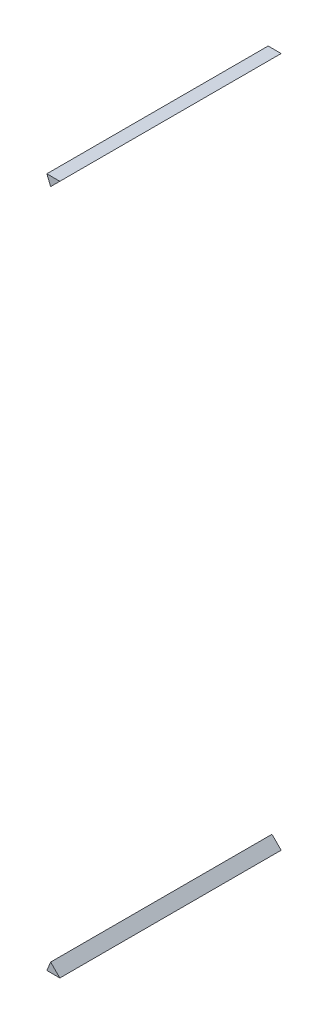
ISO-10303-21;
HEADER;
FILE_DESCRIPTION(('STEP AP214'),'2;1');
FILE_NAME('part.step','',(''),(''),'','','');
FILE_SCHEMA(('AUTOMOTIVE_DESIGN { 1 0 10303 214 1 1 1 1 }'));
ENDSEC;
DATA;
#1=APPLICATION_CONTEXT('core data for automotive mechanical design processes');
#2=APPLICATION_PROTOCOL_DEFINITION('international standard','automotive_design',2000,#1);
#3=PRODUCT_CONTEXT('',#1,'mechanical');
#4=PRODUCT('Part','Part','',(#3));
#5=PRODUCT_RELATED_PRODUCT_CATEGORY('part','',(#4));
#6=PRODUCT_DEFINITION_FORMATION('','',#4);
#7=PRODUCT_DEFINITION_CONTEXT('part definition',#1,'design');
#8=PRODUCT_DEFINITION('design','',#6,#7);
#9=PRODUCT_DEFINITION_SHAPE('','',#8);
#10=(LENGTH_UNIT() NAMED_UNIT(*) SI_UNIT(.MILLI.,.METRE.));
#11=(NAMED_UNIT(*) PLANE_ANGLE_UNIT() SI_UNIT($,.RADIAN.));
#12=(NAMED_UNIT(*) SI_UNIT($,.STERADIAN.) SOLID_ANGLE_UNIT());
#13=UNCERTAINTY_MEASURE_WITH_UNIT(LENGTH_MEASURE(1.E-05),#10,'distance_accuracy_value','');
#14=(GEOMETRIC_REPRESENTATION_CONTEXT(3) GLOBAL_UNCERTAINTY_ASSIGNED_CONTEXT((#13)) GLOBAL_UNIT_ASSIGNED_CONTEXT((#10,
#11,#12)) REPRESENTATION_CONTEXT('',''));
#15=CARTESIAN_POINT('',(0.,0.,0.));
#16=DIRECTION('',(0.,0.,1.));
#17=DIRECTION('',(1.,0.,0.));
#18=AXIS2_PLACEMENT_3D('',#15,#16,#17);
#19=CARTESIAN_POINT('',(512.126946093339,102.745484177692,19.9999999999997));
#20=DIRECTION('',(0.,0.,1.));
#21=DIRECTION('',(1.,0.,0.));
#22=AXIS2_PLACEMENT_3D('',#19,#20,#21);
#23=PLANE('',#22);
#24=DIRECTION('',(-0.382683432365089,-0.923879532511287,0.));
#25=VECTOR('',#24,1.);
#26=CARTESIAN_POINT('',(507.126946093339,102.745484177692,19.9999999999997));
#27=LINE('',#26,#25);
#28=CARTESIAN_POINT('',(508.591412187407,106.281018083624,19.9999999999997));
#29=VERTEX_POINT('',#28);
#30=CARTESIAN_POINT('',(507.126946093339,102.745484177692,19.9999999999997));
#31=VERTEX_POINT('',#30);
#32=EDGE_CURVE('P0_E50',#29,#31,#27,.T.);
#33=ORIENTED_EDGE('',*,*,#32,.F.);
#34=DIRECTION('',(0.707106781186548,-0.707106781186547,0.));
#35=VECTOR('',#34,1.);
#36=CARTESIAN_POINT('',(497.126946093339,117.745484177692,19.9999999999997));
#37=LINE('',#36,#35);
#38=CARTESIAN_POINT('',(512.126946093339,102.745484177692,19.9999999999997));
#39=VERTEX_POINT('',#38);
#40=EDGE_CURVE('P0_E20',#29,#39,#37,.T.);
#41=ORIENTED_EDGE('',*,*,#40,.T.);
#42=DIRECTION('',(1.,0.,0.));
#43=VECTOR('',#42,1.);
#44=CARTESIAN_POINT('',(422.12694609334,102.745484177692,19.9999999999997));
#45=LINE('',#44,#43);
#46=EDGE_CURVE('P0_E63',#39,#31,#45,.F.);
#47=ORIENTED_EDGE('',*,*,#46,.T.);
#48=EDGE_LOOP('',(#33,#41,#47));
#49=FACE_BOUND('',#48,.T.);
#50=ADVANCED_FACE('P0_F16',(#49),#23,.F.);
#51=CARTESIAN_POINT('',(422.12694609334,102.745484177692,0.));
#52=DIRECTION('',(0.,1.,0.));
#53=DIRECTION('',(0.,0.,1.));
#54=AXIS2_PLACEMENT_3D('',#51,#52,#53);
#55=PLANE('',#54);
#56=DIRECTION('',(0.,0.,1.));
#57=VECTOR('',#56,1.);
#58=CARTESIAN_POINT('',(507.126946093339,102.745484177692,19.9999999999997));
#59=LINE('',#58,#57);
#60=CARTESIAN_POINT('',(507.126946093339,102.745484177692,105.));
#61=VERTEX_POINT('',#60);
#62=EDGE_CURVE('P0_E58',#31,#61,#59,.T.);
#63=ORIENTED_EDGE('',*,*,#62,.F.);
#64=ORIENTED_EDGE('',*,*,#46,.F.);
#65=DIRECTION('',(0.,0.,1.));
#66=VECTOR('',#65,1.);
#67=CARTESIAN_POINT('',(512.126946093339,102.745484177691,19.9999999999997));
#68=LINE('',#67,#66);
#69=CARTESIAN_POINT('',(512.126946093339,102.745484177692,105.));
#70=VERTEX_POINT('',#69);
#71=EDGE_CURVE('P0_E59',#39,#70,#68,.T.);
#72=ORIENTED_EDGE('',*,*,#71,.T.);
#73=DIRECTION('',(1.,0.,0.));
#74=VECTOR('',#73,1.);
#75=CARTESIAN_POINT('',(512.126946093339,102.745484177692,105.));
#76=LINE('',#75,#74);
#77=EDGE_CURVE('P0_E56',#61,#70,#76,.T.);
#78=ORIENTED_EDGE('',*,*,#77,.F.);
#79=EDGE_LOOP('',(#63,#64,#72,#78));
#80=FACE_BOUND('',#79,.T.);
#81=ADVANCED_FACE('P0_F57',(#80),#55,.F.);
#82=CARTESIAN_POINT('',(512.126946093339,102.745484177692,105.));
#83=DIRECTION('',(0.,0.,1.));
#84=DIRECTION('',(1.,0.,0.));
#85=AXIS2_PLACEMENT_3D('',#82,#83,#84);
#86=PLANE('',#85);
#87=DIRECTION('',(0.707106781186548,-0.707106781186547,0.));
#88=VECTOR('',#87,1.);
#89=CARTESIAN_POINT('',(497.12694609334,117.745484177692,105.));
#90=LINE('',#89,#88);
#91=CARTESIAN_POINT('',(508.591412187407,106.281018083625,105.));
#92=VERTEX_POINT('',#91);
#93=EDGE_CURVE('P0_E26',#70,#92,#90,.F.);
#94=ORIENTED_EDGE('',*,*,#93,.T.);
#95=DIRECTION('',(-0.382683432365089,-0.923879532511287,0.));
#96=VECTOR('',#95,1.);
#97=CARTESIAN_POINT('',(507.126946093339,102.745484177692,105.));
#98=LINE('',#97,#96);
#99=EDGE_CURVE('P0_E34',#61,#92,#98,.F.);
#100=ORIENTED_EDGE('',*,*,#99,.F.);
#101=ORIENTED_EDGE('',*,*,#77,.T.);
#102=EDGE_LOOP('',(#94,#100,#101));
#103=FACE_BOUND('',#102,.T.);
#104=ADVANCED_FACE('P0_F67',(#103),#86,.T.);
#105=CARTESIAN_POINT('',(507.126946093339,102.745484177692,19.9999999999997));
#106=DIRECTION('',(-0.923879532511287,0.382683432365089,0.));
#107=DIRECTION('',(-0.382683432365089,-0.923879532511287,0.));
#108=AXIS2_PLACEMENT_3D('',#105,#106,#107);
#109=PLANE('',#108);
#110=ORIENTED_EDGE('',*,*,#32,.T.);
#111=ORIENTED_EDGE('',*,*,#62,.T.);
#112=ORIENTED_EDGE('',*,*,#99,.T.);
#113=DIRECTION('',(0.,0.,1.));
#114=VECTOR('',#113,1.);
#115=CARTESIAN_POINT('',(508.591412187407,106.281018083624,19.9999999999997));
#116=LINE('',#115,#114);
#117=EDGE_CURVE('P0_E10',#92,#29,#116,.F.);
#118=ORIENTED_EDGE('',*,*,#117,.T.);
#119=EDGE_LOOP('',(#110,#111,#112,#118));
#120=FACE_BOUND('',#119,.T.);
#121=ADVANCED_FACE('P0_F65',(#120),#109,.T.);
#122=CARTESIAN_POINT('',(497.126946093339,117.745484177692,19.9999999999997));
#123=DIRECTION('',(-0.707106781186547,-0.707106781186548,0.));
#124=DIRECTION('',(0.707106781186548,-0.707106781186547,0.));
#125=AXIS2_PLACEMENT_3D('',#122,#123,#124);
#126=PLANE('',#125);
#127=ORIENTED_EDGE('',*,*,#93,.F.);
#128=ORIENTED_EDGE('',*,*,#71,.F.);
#129=ORIENTED_EDGE('',*,*,#40,.F.);
#130=ORIENTED_EDGE('',*,*,#117,.F.);
#131=EDGE_LOOP('',(#127,#128,#129,#130));
#132=FACE_BOUND('',#131,.T.);
#133=ADVANCED_FACE('P0_F18',(#132),#126,.F.);
#134=CLOSED_SHELL('',(#50,#81,#104,#121,#133));
#135=MANIFOLD_SOLID_BREP('P0_B1',#134);
#136=CARTESIAN_POINT('',(508.591412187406,364.209950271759,19.9999999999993));
#137=DIRECTION('',(-0.923879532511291,-0.382683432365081,0.));
#138=DIRECTION('',(0.382683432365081,-0.923879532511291,0.));
#139=AXIS2_PLACEMENT_3D('',#136,#137,#138);
#140=PLANE('',#139);
#141=DIRECTION('',(0.382683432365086,-0.923879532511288,0.));
#142=VECTOR('',#141,1.);
#143=CARTESIAN_POINT('',(507.126946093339,367.745484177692,19.9999999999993));
#144=LINE('',#143,#142);
#145=CARTESIAN_POINT('',(507.126946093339,367.745484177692,19.9999999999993));
#146=VERTEX_POINT('',#145);
#147=CARTESIAN_POINT('',(508.591412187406,364.209950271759,19.9999999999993));
#148=VERTEX_POINT('',#147);
#149=EDGE_CURVE('P1_E54',#146,#148,#144,.T.);
#150=ORIENTED_EDGE('',*,*,#149,.T.);
#151=DIRECTION('',(0.,0.,1.));
#152=VECTOR('',#151,1.);
#153=CARTESIAN_POINT('',(508.591412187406,364.209950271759,19.9999999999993));
#154=LINE('',#153,#152);
#155=CARTESIAN_POINT('',(508.591412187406,364.209950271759,104.999999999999));
#156=VERTEX_POINT('',#155);
#157=EDGE_CURVE('P1_E53',#148,#156,#154,.T.);
#158=ORIENTED_EDGE('',*,*,#157,.T.);
#159=DIRECTION('',(0.382683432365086,-0.923879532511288,0.));
#160=VECTOR('',#159,1.);
#161=CARTESIAN_POINT('',(507.126946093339,367.745484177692,104.999999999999));
#162=LINE('',#161,#160);
#163=CARTESIAN_POINT('',(507.126946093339,367.745484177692,104.999999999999));
#164=VERTEX_POINT('',#163);
#165=EDGE_CURVE('P1_E69',#164,#156,#162,.T.);
#166=ORIENTED_EDGE('',*,*,#165,.F.);
#167=DIRECTION('',(0.,0.,-1.));
#168=VECTOR('',#167,1.);
#169=CARTESIAN_POINT('',(507.126946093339,367.745484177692,0.));
#170=LINE('',#169,#168);
#171=EDGE_CURVE('P1_E20',#164,#146,#170,.T.);
#172=ORIENTED_EDGE('',*,*,#171,.T.);
#173=EDGE_LOOP('',(#150,#158,#166,#172));
#174=FACE_BOUND('',#173,.T.);
#175=ADVANCED_FACE('P1_F16',(#174),#140,.T.);
#176=CARTESIAN_POINT('',(512.126946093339,367.745484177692,19.9999999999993));
#177=DIRECTION('',(0.,0.,1.));
#178=DIRECTION('',(1.,0.,0.));
#179=AXIS2_PLACEMENT_3D('',#176,#177,#178);
#180=PLANE('',#179);
#181=ORIENTED_EDGE('',*,*,#149,.F.);
#182=DIRECTION('',(1.,0.,0.));
#183=VECTOR('',#182,1.);
#184=CARTESIAN_POINT('',(817.156383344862,367.745484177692,19.9999999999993));
#185=LINE('',#184,#183);
#186=CARTESIAN_POINT('',(512.126946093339,367.745484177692,19.9999999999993));
#187=VERTEX_POINT('',#186);
#188=EDGE_CURVE('P1_E66',#146,#187,#185,.T.);
#189=ORIENTED_EDGE('',*,*,#188,.T.);
#190=DIRECTION('',(-0.707106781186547,-0.707106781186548,0.));
#191=VECTOR('',#190,1.);
#192=CARTESIAN_POINT('',(497.126946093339,352.745484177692,19.9999999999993));
#193=LINE('',#192,#191);
#194=EDGE_CURVE('P1_E58',#187,#148,#193,.T.);
#195=ORIENTED_EDGE('',*,*,#194,.T.);
#196=EDGE_LOOP('',(#181,#189,#195));
#197=FACE_BOUND('',#196,.T.);
#198=ADVANCED_FACE('P1_F65',(#197),#180,.F.);
#199=CARTESIAN_POINT('',(497.126946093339,352.745484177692,19.9999999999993));
#200=DIRECTION('',(-0.707106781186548,0.707106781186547,0.));
#201=DIRECTION('',(-0.707106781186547,-0.707106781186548,0.));
#202=AXIS2_PLACEMENT_3D('',#199,#200,#201);
#203=PLANE('',#202);
#204=ORIENTED_EDGE('',*,*,#194,.F.);
#205=DIRECTION('',(0.,0.,-1.));
#206=VECTOR('',#205,1.);
#207=CARTESIAN_POINT('',(512.126946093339,367.745484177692,0.));
#208=LINE('',#207,#206);
#209=CARTESIAN_POINT('',(512.126946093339,367.745484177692,104.999999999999));
#210=VERTEX_POINT('',#209);
#211=EDGE_CURVE('P1_E26',#187,#210,#208,.F.);
#212=ORIENTED_EDGE('',*,*,#211,.T.);
#213=DIRECTION('',(0.707106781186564,0.707106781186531,0.));
#214=VECTOR('',#213,1.);
#215=CARTESIAN_POINT('',(508.591412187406,364.209950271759,104.999999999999));
#216=LINE('',#215,#214);
#217=EDGE_CURVE('P1_E34',#156,#210,#216,.T.);
#218=ORIENTED_EDGE('',*,*,#217,.F.);
#219=ORIENTED_EDGE('',*,*,#157,.F.);
#220=EDGE_LOOP('',(#204,#212,#218,#219));
#221=FACE_BOUND('',#220,.T.);
#222=ADVANCED_FACE('P1_F61',(#221),#203,.F.);
#223=CARTESIAN_POINT('',(512.126946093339,367.745484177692,104.999999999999));
#224=DIRECTION('',(0.,0.,1.));
#225=DIRECTION('',(1.,0.,0.));
#226=AXIS2_PLACEMENT_3D('',#223,#224,#225);
#227=PLANE('',#226);
#228=DIRECTION('',(1.,0.,0.));
#229=VECTOR('',#228,1.);
#230=CARTESIAN_POINT('',(817.156383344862,367.745484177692,104.999999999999));
#231=LINE('',#230,#229);
#232=EDGE_CURVE('P1_E10',#210,#164,#231,.F.);
#233=ORIENTED_EDGE('',*,*,#232,.T.);
#234=ORIENTED_EDGE('',*,*,#165,.T.);
#235=ORIENTED_EDGE('',*,*,#217,.T.);
#236=EDGE_LOOP('',(#233,#234,#235));
#237=FACE_BOUND('',#236,.T.);
#238=ADVANCED_FACE('P1_F72',(#237),#227,.T.);
#239=CARTESIAN_POINT('',(817.156383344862,367.745484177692,0.));
#240=DIRECTION('',(0.,-1.,0.));
#241=DIRECTION('',(0.,0.,-1.));
#242=AXIS2_PLACEMENT_3D('',#239,#240,#241);
#243=PLANE('',#242);
#244=ORIENTED_EDGE('',*,*,#211,.F.);
#245=ORIENTED_EDGE('',*,*,#188,.F.);
#246=ORIENTED_EDGE('',*,*,#171,.F.);
#247=ORIENTED_EDGE('',*,*,#232,.F.);
#248=EDGE_LOOP('',(#244,#245,#246,#247));
#249=FACE_BOUND('',#248,.T.);
#250=ADVANCED_FACE('P1_F18',(#249),#243,.F.);
#251=CLOSED_SHELL('',(#175,#198,#222,#238,#250));
#252=MANIFOLD_SOLID_BREP('P1_B1',#251);
#253=ADVANCED_BREP_SHAPE_REPRESENTATION('',(#18,#135,#252),#14);
#254=SHAPE_DEFINITION_REPRESENTATION(#9,#253);
ENDSEC;
END-ISO-10303-21;
